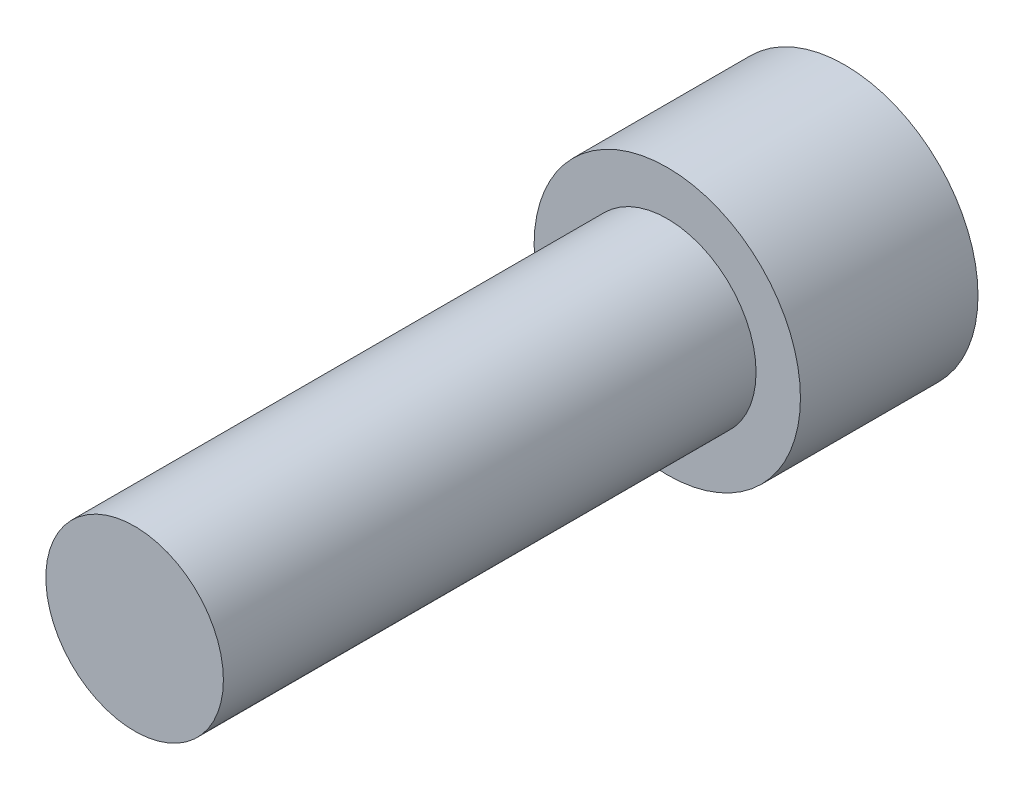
from build123d import *

# Parameters (mm, degrees)
HEX_2_DEPTH = 3.556


with BuildPart() as part:
    # Sketch6 → Revolve1 (revolve)
    with BuildSketch(Plane(origin=(0, 0, 0), x_dir=(0, 0, -1), z_dir=(1, 0, 0)), mode=Mode.PRIVATE) as revolve1_sk:
        Polygon((-19.05, 0), (-19.05, -3.175), (0, -3.175), (0, -4.7625), (6.35, -4.7625), (6.35, 0), align=None)
    revolve(revolve1_sk.sketch.rotate(Axis((0, 0, 19.05), (0, 0, -1)), 270), axis=Axis((0, 0, 19.05), (0, 0, -1)))

    # Sketch7 → HEX 2 (cut)
    with BuildSketch(Plane(origin=(0, 0, -6.35), x_dir=(-1, 0, 0), z_dir=(0, 0, -1))):
        Polygon((-2.3876, 1.378481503), (-2.3876, -1.378481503), (0, -2.756963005), (2.3876, -1.378481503), (2.3876, 1.378481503), (0, 2.756963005), align=None)
    extrude(amount=-HEX_2_DEPTH, mode=Mode.SUBTRACT)


solid = part.part
